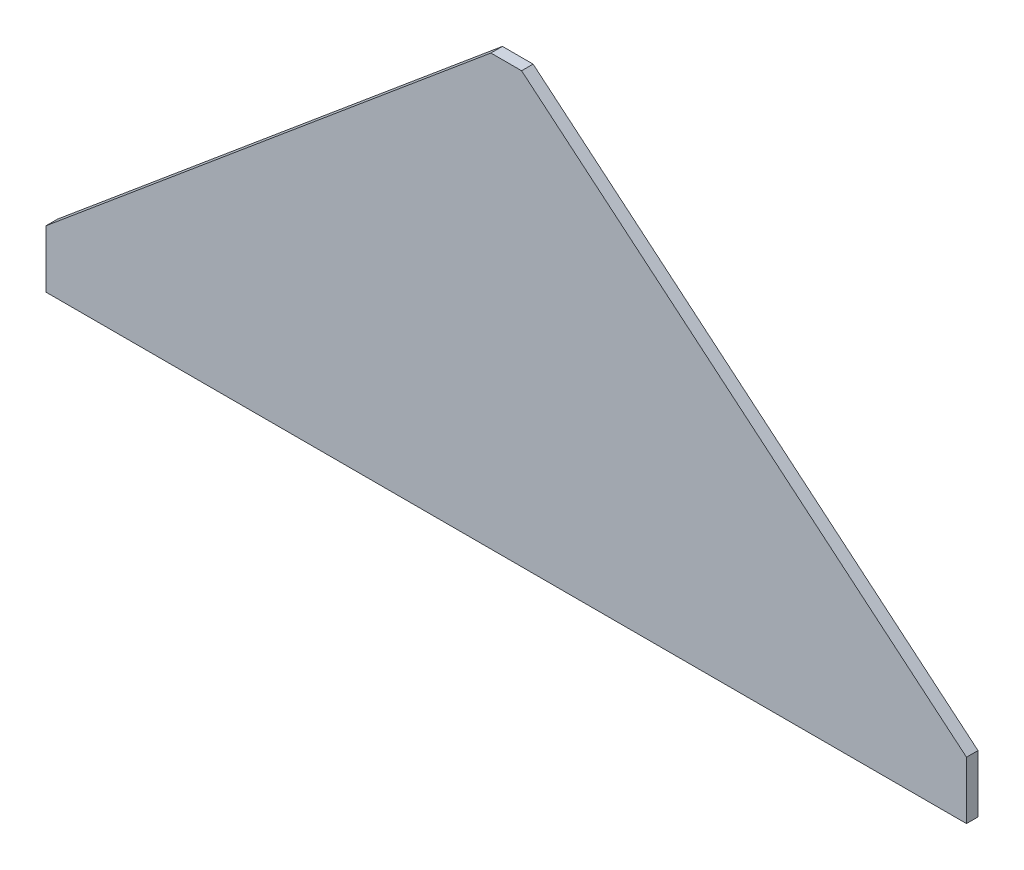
ISO-10303-21;
HEADER;
FILE_DESCRIPTION(('STEP AP214'),'2;1');
FILE_NAME('part.step','',(''),(''),'','','');
FILE_SCHEMA(('AUTOMOTIVE_DESIGN { 1 0 10303 214 1 1 1 1 }'));
ENDSEC;
DATA;
#1=APPLICATION_CONTEXT('core data for automotive mechanical design processes');
#2=APPLICATION_PROTOCOL_DEFINITION('international standard','automotive_design',2000,#1);
#3=PRODUCT_CONTEXT('',#1,'mechanical');
#4=PRODUCT('Part','Part','',(#3));
#5=PRODUCT_RELATED_PRODUCT_CATEGORY('part','',(#4));
#6=PRODUCT_DEFINITION_FORMATION('','',#4);
#7=PRODUCT_DEFINITION_CONTEXT('part definition',#1,'design');
#8=PRODUCT_DEFINITION('design','',#6,#7);
#9=PRODUCT_DEFINITION_SHAPE('','',#8);
#10=(LENGTH_UNIT() NAMED_UNIT(*) SI_UNIT(.MILLI.,.METRE.));
#11=(NAMED_UNIT(*) PLANE_ANGLE_UNIT() SI_UNIT($,.RADIAN.));
#12=(NAMED_UNIT(*) SI_UNIT($,.STERADIAN.) SOLID_ANGLE_UNIT());
#13=UNCERTAINTY_MEASURE_WITH_UNIT(LENGTH_MEASURE(1.E-05),#10,'distance_accuracy_value','');
#14=(GEOMETRIC_REPRESENTATION_CONTEXT(3) GLOBAL_UNCERTAINTY_ASSIGNED_CONTEXT((#13)) GLOBAL_UNIT_ASSIGNED_CONTEXT((#10,
#11,#12)) REPRESENTATION_CONTEXT('',''));
#15=CARTESIAN_POINT('',(0.,0.,0.));
#16=DIRECTION('',(0.,0.,1.));
#17=DIRECTION('',(1.,0.,0.));
#18=AXIS2_PLACEMENT_3D('',#15,#16,#17);
#19=CARTESIAN_POINT('',(0.,0.,3.));
#20=DIRECTION('',(1.,0.,0.));
#21=DIRECTION('',(0.,0.,-1.));
#22=AXIS2_PLACEMENT_3D('',#19,#20,#21);
#23=PLANE('',#22);
#24=DIRECTION('',(0.,-1.,0.));
#25=VECTOR('',#24,1.);
#26=CARTESIAN_POINT('',(0.,0.,3.));
#27=LINE('',#26,#25);
#28=CARTESIAN_POINT('',(0.,15.,3.));
#29=VERTEX_POINT('',#28);
#30=CARTESIAN_POINT('',(0.,0.,3.));
#31=VERTEX_POINT('',#30);
#32=EDGE_CURVE('E99',#29,#31,#27,.T.);
#33=ORIENTED_EDGE('',*,*,#32,.F.);
#34=DIRECTION('',(0.,0.,1.));
#35=VECTOR('',#34,1.);
#36=CARTESIAN_POINT('',(0.,15.,0.));
#37=LINE('',#36,#35);
#38=CARTESIAN_POINT('',(0.,15.,0.));
#39=VERTEX_POINT('',#38);
#40=EDGE_CURVE('E133',#39,#29,#37,.T.);
#41=ORIENTED_EDGE('',*,*,#40,.F.);
#42=DIRECTION('',(0.,-1.,0.));
#43=VECTOR('',#42,1.);
#44=CARTESIAN_POINT('',(0.,0.,0.));
#45=LINE('',#44,#43);
#46=CARTESIAN_POINT('',(0.,0.,0.));
#47=VERTEX_POINT('',#46);
#48=EDGE_CURVE('E120',#39,#47,#45,.T.);
#49=ORIENTED_EDGE('',*,*,#48,.T.);
#50=DIRECTION('',(0.,0.,-1.));
#51=VECTOR('',#50,1.);
#52=CARTESIAN_POINT('',(0.,0.,3.));
#53=LINE('',#52,#51);
#54=EDGE_CURVE('E11',#31,#47,#53,.T.);
#55=ORIENTED_EDGE('',*,*,#54,.F.);
#56=EDGE_LOOP('',(#33,#41,#49,#55));
#57=FACE_BOUND('',#56,.T.);
#58=ADVANCED_FACE('F31',(#57),#23,.F.);
#59=CARTESIAN_POINT('',(0.,0.,3.));
#60=DIRECTION('',(0.,1.,0.));
#61=DIRECTION('',(0.,0.,1.));
#62=AXIS2_PLACEMENT_3D('',#59,#60,#61);
#63=PLANE('',#62);
#64=DIRECTION('',(1.,0.,0.));
#65=VECTOR('',#64,1.);
#66=CARTESIAN_POINT('',(0.,0.,0.));
#67=LINE('',#66,#65);
#68=CARTESIAN_POINT('',(240.,0.,0.));
#69=VERTEX_POINT('',#68);
#70=EDGE_CURVE('E104',#47,#69,#67,.T.);
#71=ORIENTED_EDGE('',*,*,#70,.T.);
#72=DIRECTION('',(0.,0.,-1.));
#73=VECTOR('',#72,1.);
#74=CARTESIAN_POINT('',(240.,0.,3.));
#75=LINE('',#74,#73);
#76=CARTESIAN_POINT('',(240.,0.,3.));
#77=VERTEX_POINT('',#76);
#78=EDGE_CURVE('E38',#77,#69,#75,.T.);
#79=ORIENTED_EDGE('',*,*,#78,.F.);
#80=DIRECTION('',(1.,0.,0.));
#81=VECTOR('',#80,1.);
#82=CARTESIAN_POINT('',(0.,0.,3.));
#83=LINE('',#82,#81);
#84=EDGE_CURVE('E102',#31,#77,#83,.T.);
#85=ORIENTED_EDGE('',*,*,#84,.F.);
#86=ORIENTED_EDGE('',*,*,#54,.T.);
#87=EDGE_LOOP('',(#71,#79,#85,#86));
#88=FACE_BOUND('',#87,.T.);
#89=ADVANCED_FACE('F124',(#88),#63,.F.);
#90=CARTESIAN_POINT('',(240.,0.,3.));
#91=DIRECTION('',(-1.,0.,0.));
#92=DIRECTION('',(0.,0.,1.));
#93=AXIS2_PLACEMENT_3D('',#90,#91,#92);
#94=PLANE('',#93);
#95=DIRECTION('',(0.,1.,0.));
#96=VECTOR('',#95,1.);
#97=CARTESIAN_POINT('',(240.,0.,0.));
#98=LINE('',#97,#96);
#99=CARTESIAN_POINT('',(240.,15.,0.));
#100=VERTEX_POINT('',#99);
#101=EDGE_CURVE('E100',#69,#100,#98,.T.);
#102=ORIENTED_EDGE('',*,*,#101,.T.);
#103=DIRECTION('',(0.,0.,1.));
#104=VECTOR('',#103,1.);
#105=CARTESIAN_POINT('',(240.,15.,0.));
#106=LINE('',#105,#104);
#107=CARTESIAN_POINT('',(240.,15.,3.));
#108=VERTEX_POINT('',#107);
#109=EDGE_CURVE('E45',#100,#108,#106,.T.);
#110=ORIENTED_EDGE('',*,*,#109,.T.);
#111=DIRECTION('',(0.,1.,0.));
#112=VECTOR('',#111,1.);
#113=CARTESIAN_POINT('',(240.,0.,3.));
#114=LINE('',#113,#112);
#115=EDGE_CURVE('E111',#77,#108,#114,.T.);
#116=ORIENTED_EDGE('',*,*,#115,.F.);
#117=ORIENTED_EDGE('',*,*,#78,.T.);
#118=EDGE_LOOP('',(#102,#110,#116,#117));
#119=FACE_BOUND('',#118,.T.);
#120=ADVANCED_FACE('F127',(#119),#94,.F.);
#121=CARTESIAN_POINT('',(0.,112.,3.));
#122=DIRECTION('',(0.,-1.,0.));
#123=DIRECTION('',(0.,0.,-1.));
#124=AXIS2_PLACEMENT_3D('',#121,#122,#123);
#125=PLANE('',#124);
#126=DIRECTION('',(-1.,0.,0.));
#127=VECTOR('',#126,1.);
#128=CARTESIAN_POINT('',(0.,112.,3.));
#129=LINE('',#128,#127);
#130=CARTESIAN_POINT('',(124.,112.,3.));
#131=VERTEX_POINT('',#130);
#132=CARTESIAN_POINT('',(116.,112.,3.));
#133=VERTEX_POINT('',#132);
#134=EDGE_CURVE('E93',#131,#133,#129,.T.);
#135=ORIENTED_EDGE('',*,*,#134,.F.);
#136=DIRECTION('',(0.,0.,1.));
#137=VECTOR('',#136,1.);
#138=CARTESIAN_POINT('',(124.,112.,0.));
#139=LINE('',#138,#137);
#140=CARTESIAN_POINT('',(124.,112.,0.));
#141=VERTEX_POINT('',#140);
#142=EDGE_CURVE('E84',#141,#131,#139,.T.);
#143=ORIENTED_EDGE('',*,*,#142,.F.);
#144=DIRECTION('',(-1.,0.,0.));
#145=VECTOR('',#144,1.);
#146=CARTESIAN_POINT('',(0.,112.,0.));
#147=LINE('',#146,#145);
#148=CARTESIAN_POINT('',(116.,112.,0.));
#149=VERTEX_POINT('',#148);
#150=EDGE_CURVE('E53',#141,#149,#147,.T.);
#151=ORIENTED_EDGE('',*,*,#150,.T.);
#152=DIRECTION('',(0.,0.,1.));
#153=VECTOR('',#152,1.);
#154=CARTESIAN_POINT('',(116.,112.,0.));
#155=LINE('',#154,#153);
#156=EDGE_CURVE('E121',#149,#133,#155,.T.);
#157=ORIENTED_EDGE('',*,*,#156,.T.);
#158=EDGE_LOOP('',(#135,#143,#151,#157));
#159=FACE_BOUND('',#158,.T.);
#160=ADVANCED_FACE('F92',(#159),#125,.F.);
#161=CARTESIAN_POINT('',(0.,112.,3.));
#162=DIRECTION('',(0.,0.,-1.));
#163=DIRECTION('',(-1.,0.,0.));
#164=AXIS2_PLACEMENT_3D('',#161,#162,#163);
#165=PLANE('',#164);
#166=ORIENTED_EDGE('',*,*,#115,.T.);
#167=DIRECTION('',(0.767136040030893,-0.641484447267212,0.));
#168=VECTOR('',#167,1.);
#169=CARTESIAN_POINT('',(240.,15.,3.));
#170=LINE('',#169,#168);
#171=EDGE_CURVE('E89',#131,#108,#170,.T.);
#172=ORIENTED_EDGE('',*,*,#171,.F.);
#173=ORIENTED_EDGE('',*,*,#134,.T.);
#174=DIRECTION('',(0.767136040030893,0.641484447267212,0.));
#175=VECTOR('',#174,1.);
#176=CARTESIAN_POINT('',(0.,15.,3.));
#177=LINE('',#176,#175);
#178=EDGE_CURVE('E128',#29,#133,#177,.T.);
#179=ORIENTED_EDGE('',*,*,#178,.F.);
#180=ORIENTED_EDGE('',*,*,#32,.T.);
#181=ORIENTED_EDGE('',*,*,#84,.T.);
#182=EDGE_LOOP('',(#166,#172,#173,#179,#180,#181));
#183=FACE_BOUND('',#182,.T.);
#184=ADVANCED_FACE('F130',(#183),#165,.F.);
#185=CARTESIAN_POINT('',(0.,112.,0.));
#186=DIRECTION('',(0.,0.,-1.));
#187=DIRECTION('',(-1.,0.,0.));
#188=AXIS2_PLACEMENT_3D('',#185,#186,#187);
#189=PLANE('',#188);
#190=DIRECTION('',(0.767136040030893,-0.641484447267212,0.));
#191=VECTOR('',#190,1.);
#192=CARTESIAN_POINT('',(240.,15.,0.));
#193=LINE('',#192,#191);
#194=EDGE_CURVE('E82',#141,#100,#193,.T.);
#195=ORIENTED_EDGE('',*,*,#194,.T.);
#196=ORIENTED_EDGE('',*,*,#101,.F.);
#197=ORIENTED_EDGE('',*,*,#70,.F.);
#198=ORIENTED_EDGE('',*,*,#48,.F.);
#199=DIRECTION('',(0.767136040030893,0.641484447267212,0.));
#200=VECTOR('',#199,1.);
#201=CARTESIAN_POINT('',(0.,15.,0.));
#202=LINE('',#201,#200);
#203=EDGE_CURVE('E98',#39,#149,#202,.T.);
#204=ORIENTED_EDGE('',*,*,#203,.T.);
#205=ORIENTED_EDGE('',*,*,#150,.F.);
#206=EDGE_LOOP('',(#195,#196,#197,#198,#204,#205));
#207=FACE_BOUND('',#206,.T.);
#208=ADVANCED_FACE('F96',(#207),#189,.T.);
#209=CARTESIAN_POINT('',(0.,15.,0.));
#210=DIRECTION('',(0.641484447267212,-0.767136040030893,0.));
#211=DIRECTION('',(0.767136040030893,0.641484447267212,0.));
#212=AXIS2_PLACEMENT_3D('',#209,#210,#211);
#213=PLANE('',#212);
#214=ORIENTED_EDGE('',*,*,#178,.T.);
#215=ORIENTED_EDGE('',*,*,#156,.F.);
#216=ORIENTED_EDGE('',*,*,#203,.F.);
#217=ORIENTED_EDGE('',*,*,#40,.T.);
#218=EDGE_LOOP('',(#214,#215,#216,#217));
#219=FACE_BOUND('',#218,.T.);
#220=ADVANCED_FACE('F139',(#219),#213,.F.);
#221=CARTESIAN_POINT('',(240.,15.,0.));
#222=DIRECTION('',(-0.641484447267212,-0.767136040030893,0.));
#223=DIRECTION('',(0.767136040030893,-0.641484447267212,0.));
#224=AXIS2_PLACEMENT_3D('',#221,#222,#223);
#225=PLANE('',#224);
#226=ORIENTED_EDGE('',*,*,#171,.T.);
#227=ORIENTED_EDGE('',*,*,#109,.F.);
#228=ORIENTED_EDGE('',*,*,#194,.F.);
#229=ORIENTED_EDGE('',*,*,#142,.T.);
#230=EDGE_LOOP('',(#226,#227,#228,#229));
#231=FACE_BOUND('',#230,.T.);
#232=ADVANCED_FACE('F83',(#231),#225,.F.);
#233=CLOSED_SHELL('',(#58,#89,#120,#160,#184,#208,#220,#232));
#234=MANIFOLD_SOLID_BREP('B2',#233);
#235=ADVANCED_BREP_SHAPE_REPRESENTATION('',(#18,#234),#14);
#236=SHAPE_DEFINITION_REPRESENTATION(#9,#235);
ENDSEC;
END-ISO-10303-21;
